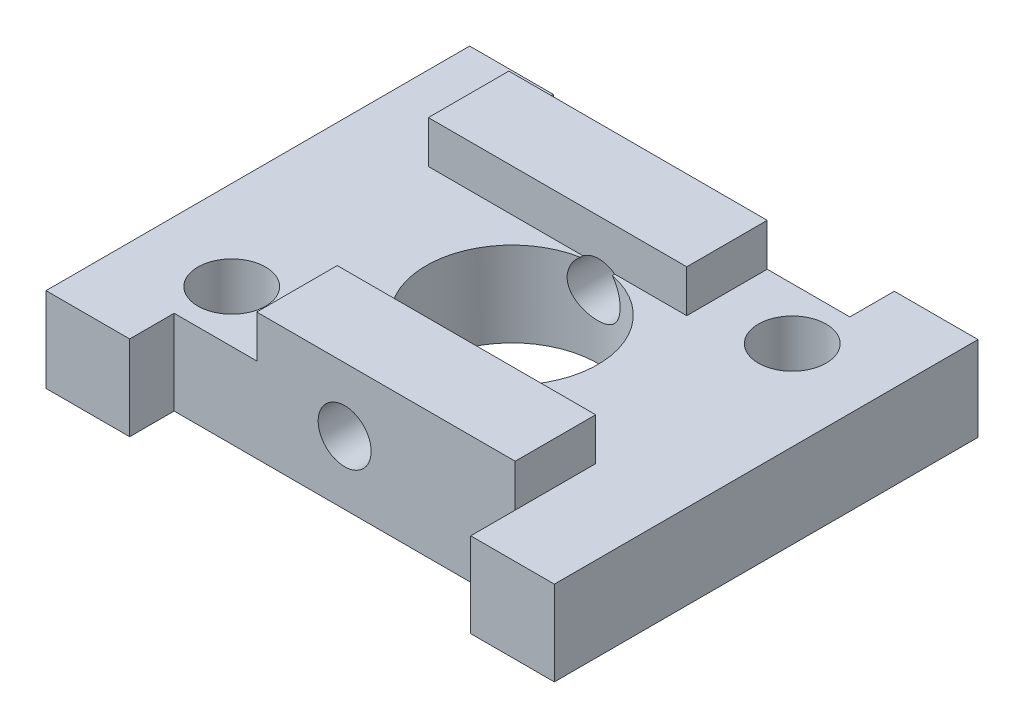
ISO-10303-21;
HEADER;
FILE_DESCRIPTION(('STEP AP214'),'2;1');
FILE_NAME('part.step','',(''),(''),'','','');
FILE_SCHEMA(('AUTOMOTIVE_DESIGN { 1 0 10303 214 1 1 1 1 }'));
ENDSEC;
DATA;
#1=APPLICATION_CONTEXT('core data for automotive mechanical design processes');
#2=APPLICATION_PROTOCOL_DEFINITION('international standard','automotive_design',2000,#1);
#3=PRODUCT_CONTEXT('',#1,'mechanical');
#4=PRODUCT('Part','Part','',(#3));
#5=PRODUCT_RELATED_PRODUCT_CATEGORY('part','',(#4));
#6=PRODUCT_DEFINITION_FORMATION('','',#4);
#7=PRODUCT_DEFINITION_CONTEXT('part definition',#1,'design');
#8=PRODUCT_DEFINITION('design','',#6,#7);
#9=PRODUCT_DEFINITION_SHAPE('','',#8);
#10=(LENGTH_UNIT() NAMED_UNIT(*) SI_UNIT(.MILLI.,.METRE.));
#11=(NAMED_UNIT(*) PLANE_ANGLE_UNIT() SI_UNIT($,.RADIAN.));
#12=(NAMED_UNIT(*) SI_UNIT($,.STERADIAN.) SOLID_ANGLE_UNIT());
#13=UNCERTAINTY_MEASURE_WITH_UNIT(LENGTH_MEASURE(1.E-05),#10,'distance_accuracy_value','');
#14=(GEOMETRIC_REPRESENTATION_CONTEXT(3) GLOBAL_UNCERTAINTY_ASSIGNED_CONTEXT((#13)) GLOBAL_UNIT_ASSIGNED_CONTEXT((#10,
#11,#12)) REPRESENTATION_CONTEXT('',''));
#15=CARTESIAN_POINT('',(0.,0.,0.));
#16=DIRECTION('',(0.,0.,1.));
#17=DIRECTION('',(1.,0.,0.));
#18=AXIS2_PLACEMENT_3D('',#15,#16,#17);
#19=CARTESIAN_POINT('',(0.,2.,0.));
#20=DIRECTION('',(0.,1.,0.));
#21=DIRECTION('',(0.,0.,1.));
#22=AXIS2_PLACEMENT_3D('',#19,#20,#21);
#23=PLANE('',#22);
#24=DIRECTION('',(0.,0.,-1.));
#25=VECTOR('',#24,1.);
#26=CARTESIAN_POINT('',(0.37499999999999,2.,-3.95));
#27=LINE('',#26,#25);
#28=CARTESIAN_POINT('',(0.375000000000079,2.00000000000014,-1.98997487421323));
#29=VERTEX_POINT('',#28);
#30=CARTESIAN_POINT('',(0.37499999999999,2.,-2.05));
#31=VERTEX_POINT('',#30);
#32=EDGE_CURVE('E204',#29,#31,#27,.T.);
#33=ORIENTED_EDGE('',*,*,#32,.F.);
#34=CARTESIAN_POINT('',(0.,2.,0.));
#35=DIRECTION('',(0.,1.,0.));
#36=DIRECTION('',(0.,0.,1.));
#37=AXIS2_PLACEMENT_3D('',#34,#35,#36);
#38=CIRCLE('',#37,2.025);
#39=CARTESIAN_POINT('',(0.37499999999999,2.,1.98997487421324));
#40=VERTEX_POINT('',#39);
#41=EDGE_CURVE('E213',#40,#29,#38,.T.);
#42=ORIENTED_EDGE('',*,*,#41,.F.);
#43=DIRECTION('',(0.,0.,1.));
#44=VECTOR('',#43,1.);
#45=CARTESIAN_POINT('',(0.37499999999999,2.,3.95));
#46=LINE('',#45,#44);
#47=CARTESIAN_POINT('',(0.37499999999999,2.,2.05));
#48=VERTEX_POINT('',#47);
#49=EDGE_CURVE('E71',#48,#40,#46,.F.);
#50=ORIENTED_EDGE('',*,*,#49,.F.);
#51=DIRECTION('',(-1.,0.,0.));
#52=VECTOR('',#51,1.);
#53=CARTESIAN_POINT('',(4.025,2.,2.05));
#54=LINE('',#53,#52);
#55=CARTESIAN_POINT('',(4.025,2.,2.05));
#56=VERTEX_POINT('',#55);
#57=EDGE_CURVE('E749',#56,#48,#54,.T.);
#58=ORIENTED_EDGE('',*,*,#57,.F.);
#59=DIRECTION('',(0.,0.,-1.));
#60=VECTOR('',#59,1.);
#61=CARTESIAN_POINT('',(4.025,2.,3.95));
#62=LINE('',#61,#60);
#63=CARTESIAN_POINT('',(4.025,2.,3.95));
#64=VERTEX_POINT('',#63);
#65=EDGE_CURVE('E754',#64,#56,#62,.T.);
#66=ORIENTED_EDGE('',*,*,#65,.F.);
#67=DIRECTION('',(0.,0.,-1.));
#68=VECTOR('',#67,1.);
#69=CARTESIAN_POINT('',(4.025,2.,5.));
#70=LINE('',#69,#68);
#71=CARTESIAN_POINT('',(4.025,2.,5.));
#72=VERTEX_POINT('',#71);
#73=EDGE_CURVE('E359',#72,#64,#70,.T.);
#74=ORIENTED_EDGE('',*,*,#73,.F.);
#75=DIRECTION('',(1.,0.,0.));
#76=VECTOR('',#75,1.);
#77=CARTESIAN_POINT('',(-6.,2.,5.));
#78=LINE('',#77,#76);
#79=CARTESIAN_POINT('',(6.,2.,5.));
#80=VERTEX_POINT('',#79);
#81=EDGE_CURVE('E253',#72,#80,#78,.T.);
#82=ORIENTED_EDGE('',*,*,#81,.T.);
#83=DIRECTION('',(0.,0.,-1.));
#84=VECTOR('',#83,1.);
#85=CARTESIAN_POINT('',(6.,2.,-5.));
#86=LINE('',#85,#84);
#87=CARTESIAN_POINT('',(6.,2.,-5.));
#88=VERTEX_POINT('',#87);
#89=EDGE_CURVE('E240',#80,#88,#86,.T.);
#90=ORIENTED_EDGE('',*,*,#89,.T.);
#91=DIRECTION('',(-1.,0.,0.));
#92=VECTOR('',#91,1.);
#93=CARTESIAN_POINT('',(-6.,2.,-5.));
#94=LINE('',#93,#92);
#95=CARTESIAN_POINT('',(4.025,2.,-5.));
#96=VERTEX_POINT('',#95);
#97=EDGE_CURVE('E246',#88,#96,#94,.T.);
#98=ORIENTED_EDGE('',*,*,#97,.T.);
#99=DIRECTION('',(0.,0.,-1.));
#100=VECTOR('',#99,1.);
#101=CARTESIAN_POINT('',(4.025,2.,-5.));
#102=LINE('',#101,#100);
#103=CARTESIAN_POINT('',(4.025,2.,-3.95));
#104=VERTEX_POINT('',#103);
#105=EDGE_CURVE('E652',#104,#96,#102,.T.);
#106=ORIENTED_EDGE('',*,*,#105,.F.);
#107=DIRECTION('',(1.,0.,0.));
#108=VECTOR('',#107,1.);
#109=CARTESIAN_POINT('',(-4.025,2.,-3.95));
#110=LINE('',#109,#108);
#111=CARTESIAN_POINT('',(2.075,2.,-3.95));
#112=VERTEX_POINT('',#111);
#113=EDGE_CURVE('E653',#112,#104,#110,.T.);
#114=ORIENTED_EDGE('',*,*,#113,.F.);
#115=DIRECTION('',(0.,0.,-1.));
#116=VECTOR('',#115,1.);
#117=CARTESIAN_POINT('',(2.075,2.,-3.95));
#118=LINE('',#117,#116);
#119=CARTESIAN_POINT('',(2.075,2.,-2.05));
#120=VERTEX_POINT('',#119);
#121=EDGE_CURVE('E708',#120,#112,#118,.T.);
#122=ORIENTED_EDGE('',*,*,#121,.F.);
#123=DIRECTION('',(1.,0.,0.));
#124=VECTOR('',#123,1.);
#125=CARTESIAN_POINT('',(-4.025,2.,-2.05));
#126=LINE('',#125,#124);
#127=EDGE_CURVE('E215',#31,#120,#126,.T.);
#128=ORIENTED_EDGE('',*,*,#127,.F.);
#129=EDGE_LOOP('',(#33,#42,#50,#58,#66,#74,#82,#90,#98,#106,#114,#122,#128));
#130=FACE_BOUND('',#129,.T.);
#131=CARTESIAN_POINT('',(3.89097221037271,2.,-2.72448807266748));
#132=DIRECTION('',(0.,1.,0.));
#133=DIRECTION('',(0.,0.,1.));
#134=AXIS2_PLACEMENT_3D('',#131,#132,#133);
#135=CIRCLE('',#134,0.799999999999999);
#136=CARTESIAN_POINT('',(3.89097221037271,2.,-1.92448807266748));
#137=VERTEX_POINT('',#136);
#138=EDGE_CURVE('E234',#137,#137,#135,.T.);
#139=ORIENTED_EDGE('',*,*,#138,.F.);
#140=EDGE_LOOP('',(#139));
#141=FACE_BOUND('',#140,.T.);
#142=ADVANCED_FACE('F43',(#130,#141),#23,.T.);
#143=DIRECTION('',(0.,0.,-1.));
#144=VECTOR('',#143,1.);
#145=CARTESIAN_POINT('',(-0.374999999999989,2.,-3.95));
#146=LINE('',#145,#144);
#147=CARTESIAN_POINT('',(-0.374999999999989,2.,-2.05));
#148=VERTEX_POINT('',#147);
#149=CARTESIAN_POINT('',(-0.374999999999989,2.,-1.98997487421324));
#150=VERTEX_POINT('',#149);
#151=EDGE_CURVE('E63',#148,#150,#146,.F.);
#152=ORIENTED_EDGE('',*,*,#151,.F.);
#153=CARTESIAN_POINT('',(-4.025,2.,-2.05));
#154=VERTEX_POINT('',#153);
#155=EDGE_CURVE('E718',#154,#148,#126,.T.);
#156=ORIENTED_EDGE('',*,*,#155,.F.);
#157=DIRECTION('',(0.,0.,1.));
#158=VECTOR('',#157,1.);
#159=CARTESIAN_POINT('',(-4.025,2.,-3.95));
#160=LINE('',#159,#158);
#161=CARTESIAN_POINT('',(-4.025,2.,-3.95));
#162=VERTEX_POINT('',#161);
#163=EDGE_CURVE('E693',#162,#154,#160,.T.);
#164=ORIENTED_EDGE('',*,*,#163,.F.);
#165=DIRECTION('',(0.,0.,1.));
#166=VECTOR('',#165,1.);
#167=CARTESIAN_POINT('',(-4.025,2.,-5.));
#168=LINE('',#167,#166);
#169=CARTESIAN_POINT('',(-4.025,2.,-5.));
#170=VERTEX_POINT('',#169);
#171=EDGE_CURVE('E370',#170,#162,#168,.T.);
#172=ORIENTED_EDGE('',*,*,#171,.F.);
#173=CARTESIAN_POINT('',(-6.,2.,-5.));
#174=VERTEX_POINT('',#173);
#175=EDGE_CURVE('E244',#170,#174,#94,.T.);
#176=ORIENTED_EDGE('',*,*,#175,.T.);
#177=DIRECTION('',(0.,0.,1.));
#178=VECTOR('',#177,1.);
#179=CARTESIAN_POINT('',(-6.,2.,-5.));
#180=LINE('',#179,#178);
#181=CARTESIAN_POINT('',(-6.,2.,5.));
#182=VERTEX_POINT('',#181);
#183=EDGE_CURVE('E250',#174,#182,#180,.T.);
#184=ORIENTED_EDGE('',*,*,#183,.T.);
#185=CARTESIAN_POINT('',(-4.025,2.,5.));
#186=VERTEX_POINT('',#185);
#187=EDGE_CURVE('E254',#182,#186,#78,.T.);
#188=ORIENTED_EDGE('',*,*,#187,.T.);
#189=DIRECTION('',(0.,0.,1.));
#190=VECTOR('',#189,1.);
#191=CARTESIAN_POINT('',(-4.025,2.,5.));
#192=LINE('',#191,#190);
#193=CARTESIAN_POINT('',(-4.025,2.,3.95));
#194=VERTEX_POINT('',#193);
#195=EDGE_CURVE('E356',#194,#186,#192,.T.);
#196=ORIENTED_EDGE('',*,*,#195,.F.);
#197=DIRECTION('',(-1.,0.,0.));
#198=VECTOR('',#197,1.);
#199=CARTESIAN_POINT('',(-4.025,2.,3.95));
#200=LINE('',#199,#198);
#201=CARTESIAN_POINT('',(-2.075,2.,3.95));
#202=VERTEX_POINT('',#201);
#203=EDGE_CURVE('E347',#202,#194,#200,.T.);
#204=ORIENTED_EDGE('',*,*,#203,.F.);
#205=DIRECTION('',(0.,0.,1.));
#206=VECTOR('',#205,1.);
#207=CARTESIAN_POINT('',(-2.075,2.,3.95));
#208=LINE('',#207,#206);
#209=CARTESIAN_POINT('',(-2.075,2.,2.05));
#210=VERTEX_POINT('',#209);
#211=EDGE_CURVE('E744',#210,#202,#208,.T.);
#212=ORIENTED_EDGE('',*,*,#211,.F.);
#213=CARTESIAN_POINT('',(-0.37499999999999,2.,2.05));
#214=VERTEX_POINT('',#213);
#215=EDGE_CURVE('E753',#214,#210,#54,.T.);
#216=ORIENTED_EDGE('',*,*,#215,.F.);
#217=DIRECTION('',(0.,0.,1.));
#218=VECTOR('',#217,1.);
#219=CARTESIAN_POINT('',(-0.37499999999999,2.,3.95));
#220=LINE('',#219,#218);
#221=CARTESIAN_POINT('',(-0.375000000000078,2.00000000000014,1.98997487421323));
#222=VERTEX_POINT('',#221);
#223=EDGE_CURVE('E758',#222,#214,#220,.T.);
#224=ORIENTED_EDGE('',*,*,#223,.F.);
#225=EDGE_CURVE('E224',#150,#222,#38,.T.);
#226=ORIENTED_EDGE('',*,*,#225,.F.);
#227=EDGE_LOOP('',(#152,#156,#164,#172,#176,#184,#188,#196,#204,#212,#216,#224,#226));
#228=FACE_BOUND('',#227,.T.);
#229=CARTESIAN_POINT('',(-3.89097221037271,2.,2.72448807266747));
#230=DIRECTION('',(0.,1.,0.));
#231=DIRECTION('',(0.,0.,1.));
#232=AXIS2_PLACEMENT_3D('',#229,#230,#231);
#233=CIRCLE('',#232,0.8);
#234=CARTESIAN_POINT('',(-3.89097221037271,2.,3.52448807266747));
#235=VERTEX_POINT('',#234);
#236=EDGE_CURVE('E327',#235,#235,#233,.T.);
#237=ORIENTED_EDGE('',*,*,#236,.F.);
#238=EDGE_LOOP('',(#237));
#239=FACE_BOUND('',#238,.T.);
#240=ADVANCED_FACE('F315',(#228,#239),#23,.T.);
#241=CARTESIAN_POINT('',(-6.,2.,-5.));
#242=DIRECTION('',(0.,0.,1.));
#243=DIRECTION('',(1.,0.,0.));
#244=AXIS2_PLACEMENT_3D('',#241,#242,#243);
#245=PLANE('',#244);
#246=ORIENTED_EDGE('',*,*,#175,.F.);
#247=DIRECTION('',(0.,1.,0.));
#248=VECTOR('',#247,1.);
#249=CARTESIAN_POINT('',(-4.025,0.,-5.));
#250=LINE('',#249,#248);
#251=CARTESIAN_POINT('',(-4.025,0.,-5.));
#252=VERTEX_POINT('',#251);
#253=EDGE_CURVE('E239',#252,#170,#250,.T.);
#254=ORIENTED_EDGE('',*,*,#253,.F.);
#255=DIRECTION('',(-1.,0.,0.));
#256=VECTOR('',#255,1.);
#257=CARTESIAN_POINT('',(-6.,0.,-5.));
#258=LINE('',#257,#256);
#259=CARTESIAN_POINT('',(-6.,0.,-5.));
#260=VERTEX_POINT('',#259);
#261=EDGE_CURVE('E229',#252,#260,#258,.T.);
#262=ORIENTED_EDGE('',*,*,#261,.T.);
#263=DIRECTION('',(0.,-1.,0.));
#264=VECTOR('',#263,1.);
#265=CARTESIAN_POINT('',(-6.,2.,-5.));
#266=LINE('',#265,#264);
#267=EDGE_CURVE('E277',#174,#260,#266,.T.);
#268=ORIENTED_EDGE('',*,*,#267,.F.);
#269=EDGE_LOOP('',(#246,#254,#262,#268));
#270=FACE_BOUND('',#269,.T.);
#271=ADVANCED_FACE('F304',(#270),#245,.F.);
#272=CARTESIAN_POINT('',(-6.,2.,5.));
#273=DIRECTION('',(0.,0.,-1.));
#274=DIRECTION('',(-1.,0.,0.));
#275=AXIS2_PLACEMENT_3D('',#272,#273,#274);
#276=PLANE('',#275);
#277=DIRECTION('',(1.,0.,0.));
#278=VECTOR('',#277,1.);
#279=CARTESIAN_POINT('',(-6.,0.,5.));
#280=LINE('',#279,#278);
#281=CARTESIAN_POINT('',(-6.,0.,5.));
#282=VERTEX_POINT('',#281);
#283=CARTESIAN_POINT('',(-4.025,0.,5.));
#284=VERTEX_POINT('',#283);
#285=EDGE_CURVE('E245',#282,#284,#280,.T.);
#286=ORIENTED_EDGE('',*,*,#285,.T.);
#287=DIRECTION('',(0.,1.,0.));
#288=VECTOR('',#287,1.);
#289=CARTESIAN_POINT('',(-4.025,0.,5.));
#290=LINE('',#289,#288);
#291=EDGE_CURVE('E355',#284,#186,#290,.T.);
#292=ORIENTED_EDGE('',*,*,#291,.T.);
#293=ORIENTED_EDGE('',*,*,#187,.F.);
#294=DIRECTION('',(0.,-1.,0.));
#295=VECTOR('',#294,1.);
#296=CARTESIAN_POINT('',(-6.,2.,5.));
#297=LINE('',#296,#295);
#298=EDGE_CURVE('E273',#182,#282,#297,.T.);
#299=ORIENTED_EDGE('',*,*,#298,.T.);
#300=EDGE_LOOP('',(#286,#292,#293,#299));
#301=FACE_BOUND('',#300,.T.);
#302=ADVANCED_FACE('F312',(#301),#276,.F.);
#303=CARTESIAN_POINT('',(0.,0.,0.));
#304=DIRECTION('',(0.,1.,0.));
#305=DIRECTION('',(0.,0.,1.));
#306=AXIS2_PLACEMENT_3D('',#303,#304,#305);
#307=PLANE('',#306);
#308=ORIENTED_EDGE('',*,*,#261,.F.);
#309=DIRECTION('',(0.,0.,1.));
#310=VECTOR('',#309,1.);
#311=CARTESIAN_POINT('',(-4.025,0.,-5.));
#312=LINE('',#311,#310);
#313=CARTESIAN_POINT('',(-4.025,0.,-3.95));
#314=VERTEX_POINT('',#313);
#315=EDGE_CURVE('E657',#252,#314,#312,.T.);
#316=ORIENTED_EDGE('',*,*,#315,.T.);
#317=DIRECTION('',(1.,0.,0.));
#318=VECTOR('',#317,1.);
#319=CARTESIAN_POINT('',(-4.025,0.,-3.95));
#320=LINE('',#319,#318);
#321=CARTESIAN_POINT('',(4.025,0.,-3.95));
#322=VERTEX_POINT('',#321);
#323=EDGE_CURVE('E661',#314,#322,#320,.T.);
#324=ORIENTED_EDGE('',*,*,#323,.T.);
#325=DIRECTION('',(0.,0.,-1.));
#326=VECTOR('',#325,1.);
#327=CARTESIAN_POINT('',(4.025,0.,-5.));
#328=LINE('',#327,#326);
#329=CARTESIAN_POINT('',(4.025,0.,-5.));
#330=VERTEX_POINT('',#329);
#331=EDGE_CURVE('E675',#322,#330,#328,.T.);
#332=ORIENTED_EDGE('',*,*,#331,.T.);
#333=CARTESIAN_POINT('',(6.,0.,-5.));
#334=VERTEX_POINT('',#333);
#335=EDGE_CURVE('E259',#334,#330,#258,.T.);
#336=ORIENTED_EDGE('',*,*,#335,.F.);
#337=DIRECTION('',(0.,0.,-1.));
#338=VECTOR('',#337,1.);
#339=CARTESIAN_POINT('',(6.,0.,-5.));
#340=LINE('',#339,#338);
#341=CARTESIAN_POINT('',(6.,0.,5.));
#342=VERTEX_POINT('',#341);
#343=EDGE_CURVE('E223',#342,#334,#340,.T.);
#344=ORIENTED_EDGE('',*,*,#343,.F.);
#345=CARTESIAN_POINT('',(4.025,0.,5.));
#346=VERTEX_POINT('',#345);
#347=EDGE_CURVE('E266',#346,#342,#280,.T.);
#348=ORIENTED_EDGE('',*,*,#347,.F.);
#349=DIRECTION('',(0.,0.,-1.));
#350=VECTOR('',#349,1.);
#351=CARTESIAN_POINT('',(4.025,0.,5.));
#352=LINE('',#351,#350);
#353=CARTESIAN_POINT('',(4.025,0.,3.95));
#354=VERTEX_POINT('',#353);
#355=EDGE_CURVE('E346',#346,#354,#352,.T.);
#356=ORIENTED_EDGE('',*,*,#355,.T.);
#357=DIRECTION('',(-1.,0.,0.));
#358=VECTOR('',#357,1.);
#359=CARTESIAN_POINT('',(-4.025,0.,3.95));
#360=LINE('',#359,#358);
#361=CARTESIAN_POINT('',(-4.025,0.,3.95));
#362=VERTEX_POINT('',#361);
#363=EDGE_CURVE('E351',#354,#362,#360,.T.);
#364=ORIENTED_EDGE('',*,*,#363,.T.);
#365=DIRECTION('',(0.,0.,1.));
#366=VECTOR('',#365,1.);
#367=CARTESIAN_POINT('',(-4.025,0.,5.));
#368=LINE('',#367,#366);
#369=EDGE_CURVE('E342',#362,#284,#368,.T.);
#370=ORIENTED_EDGE('',*,*,#369,.T.);
#371=ORIENTED_EDGE('',*,*,#285,.F.);
#372=DIRECTION('',(0.,0.,1.));
#373=VECTOR('',#372,1.);
#374=CARTESIAN_POINT('',(-6.,0.,-5.));
#375=LINE('',#374,#373);
#376=EDGE_CURVE('E263',#260,#282,#375,.T.);
#377=ORIENTED_EDGE('',*,*,#376,.F.);
#378=EDGE_LOOP('',(#308,#316,#324,#332,#336,#344,#348,#356,#364,#370,#371,#377));
#379=FACE_BOUND('',#378,.T.);
#380=CARTESIAN_POINT('',(-3.89097221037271,0.,2.72448807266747));
#381=DIRECTION('',(0.,1.,0.));
#382=DIRECTION('',(0.,0.,1.));
#383=AXIS2_PLACEMENT_3D('',#380,#381,#382);
#384=CIRCLE('',#383,0.8);
#385=CARTESIAN_POINT('',(-3.89097221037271,0.,3.52448807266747));
#386=VERTEX_POINT('',#385);
#387=EDGE_CURVE('E330',#386,#386,#384,.T.);
#388=ORIENTED_EDGE('',*,*,#387,.T.);
#389=EDGE_LOOP('',(#388));
#390=FACE_BOUND('',#389,.T.);
#391=CARTESIAN_POINT('',(3.89097221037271,0.,-2.72448807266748));
#392=DIRECTION('',(0.,1.,0.));
#393=DIRECTION('',(0.,0.,1.));
#394=AXIS2_PLACEMENT_3D('',#391,#392,#393);
#395=CIRCLE('',#394,0.799999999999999);
#396=CARTESIAN_POINT('',(3.89097221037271,0.,-1.92448807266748));
#397=VERTEX_POINT('',#396);
#398=EDGE_CURVE('E360',#397,#397,#395,.T.);
#399=ORIENTED_EDGE('',*,*,#398,.T.);
#400=EDGE_LOOP('',(#399));
#401=FACE_BOUND('',#400,.T.);
#402=CARTESIAN_POINT('',(0.,0.,0.));
#403=DIRECTION('',(0.,1.,0.));
#404=DIRECTION('',(0.,0.,1.));
#405=AXIS2_PLACEMENT_3D('',#402,#403,#404);
#406=CIRCLE('',#405,2.025);
#407=CARTESIAN_POINT('',(0.,0.,2.025));
#408=VERTEX_POINT('',#407);
#409=EDGE_CURVE('E231',#408,#408,#406,.T.);
#410=ORIENTED_EDGE('',*,*,#409,.T.);
#411=EDGE_LOOP('',(#410));
#412=FACE_BOUND('',#411,.T.);
#413=ADVANCED_FACE('F298',(#379,#390,#401,#412),#307,.F.);
#414=CARTESIAN_POINT('',(6.,2.,-5.));
#415=DIRECTION('',(-1.,0.,0.));
#416=DIRECTION('',(0.,0.,1.));
#417=AXIS2_PLACEMENT_3D('',#414,#415,#416);
#418=PLANE('',#417);
#419=ORIENTED_EDGE('',*,*,#343,.T.);
#420=DIRECTION('',(0.,-1.,0.));
#421=VECTOR('',#420,1.);
#422=CARTESIAN_POINT('',(6.,2.,-5.));
#423=LINE('',#422,#421);
#424=EDGE_CURVE('E281',#88,#334,#423,.T.);
#425=ORIENTED_EDGE('',*,*,#424,.F.);
#426=ORIENTED_EDGE('',*,*,#89,.F.);
#427=DIRECTION('',(0.,-1.,0.));
#428=VECTOR('',#427,1.);
#429=CARTESIAN_POINT('',(6.,2.,5.));
#430=LINE('',#429,#428);
#431=EDGE_CURVE('E257',#80,#342,#430,.T.);
#432=ORIENTED_EDGE('',*,*,#431,.T.);
#433=EDGE_LOOP('',(#419,#425,#426,#432));
#434=FACE_BOUND('',#433,.T.);
#435=ADVANCED_FACE('F294',(#434),#418,.F.);
#436=ORIENTED_EDGE('',*,*,#335,.T.);
#437=DIRECTION('',(0.,1.,0.));
#438=VECTOR('',#437,1.);
#439=CARTESIAN_POINT('',(4.025,0.,-5.));
#440=LINE('',#439,#438);
#441=EDGE_CURVE('E650',#330,#96,#440,.T.);
#442=ORIENTED_EDGE('',*,*,#441,.T.);
#443=ORIENTED_EDGE('',*,*,#97,.F.);
#444=ORIENTED_EDGE('',*,*,#424,.T.);
#445=EDGE_LOOP('',(#436,#442,#443,#444));
#446=FACE_BOUND('',#445,.T.);
#447=ADVANCED_FACE('F297',(#446),#245,.F.);
#448=CARTESIAN_POINT('',(-6.,2.,-5.));
#449=DIRECTION('',(1.,0.,0.));
#450=DIRECTION('',(0.,0.,-1.));
#451=AXIS2_PLACEMENT_3D('',#448,#449,#450);
#452=PLANE('',#451);
#453=ORIENTED_EDGE('',*,*,#376,.T.);
#454=ORIENTED_EDGE('',*,*,#298,.F.);
#455=ORIENTED_EDGE('',*,*,#183,.F.);
#456=ORIENTED_EDGE('',*,*,#267,.T.);
#457=EDGE_LOOP('',(#453,#454,#455,#456));
#458=FACE_BOUND('',#457,.T.);
#459=ADVANCED_FACE('F302',(#458),#452,.F.);
#460=ORIENTED_EDGE('',*,*,#81,.F.);
#461=DIRECTION('',(0.,1.,0.));
#462=VECTOR('',#461,1.);
#463=CARTESIAN_POINT('',(4.025,0.,5.));
#464=LINE('',#463,#462);
#465=EDGE_CURVE('E375',#346,#72,#464,.T.);
#466=ORIENTED_EDGE('',*,*,#465,.F.);
#467=ORIENTED_EDGE('',*,*,#347,.T.);
#468=ORIENTED_EDGE('',*,*,#431,.F.);
#469=EDGE_LOOP('',(#460,#466,#467,#468));
#470=FACE_BOUND('',#469,.T.);
#471=ADVANCED_FACE('F307',(#470),#276,.F.);
#472=CARTESIAN_POINT('',(0.,2.,0.));
#473=DIRECTION('',(0.,-1.,0.));
#474=DIRECTION('',(0.,0.,-1.));
#475=AXIS2_PLACEMENT_3D('',#472,#473,#474);
#476=CYLINDRICAL_SURFACE('',#475,2.025);
#477=CARTESIAN_POINT('',(-0.374999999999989,2.,-1.98997487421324));
#478=CARTESIAN_POINT('',(-0.403287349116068,1.97880791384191,-1.98464915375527));
#479=CARTESIAN_POINT('',(-0.429714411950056,1.95521766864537,-1.97903877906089));
#480=CARTESIAN_POINT('',(-0.47825948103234,1.90390013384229,-1.9678693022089));
#481=CARTESIAN_POINT('',(-0.500373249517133,1.87616882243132,-1.9623102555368));
#482=CARTESIAN_POINT('',(-0.539661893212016,1.81724801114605,-1.95187253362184));
#483=CARTESIAN_POINT('',(-0.556832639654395,1.78605565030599,-1.9469944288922));
#484=CARTESIAN_POINT('',(-0.58566953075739,1.7210821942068,-1.93851567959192));
#485=CARTESIAN_POINT('',(-0.5973401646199,1.68730323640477,-1.93491399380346));
#486=CARTESIAN_POINT('',(-0.614568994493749,1.61892689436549,-1.92951043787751));
#487=CARTESIAN_POINT('',(-0.620264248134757,1.58436733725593,-1.92766830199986));
#488=CARTESIAN_POINT('',(-0.62580145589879,1.51472989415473,-1.92587815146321));
#489=CARTESIAN_POINT('',(-0.625643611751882,1.4796520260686,-1.92593007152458));
#490=CARTESIAN_POINT('',(-0.61960301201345,1.41143221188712,-1.92788115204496));
#491=CARTESIAN_POINT('',(-0.613943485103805,1.37826807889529,-1.92970828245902));
#492=CARTESIAN_POINT('',(-0.597429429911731,1.31338850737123,-1.93488427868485));
#493=CARTESIAN_POINT('',(-0.586574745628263,1.28167311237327,-1.93823319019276));
#494=CARTESIAN_POINT('',(-0.559838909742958,1.2200940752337,-1.9461246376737));
#495=CARTESIAN_POINT('',(-0.543892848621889,1.19026065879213,-1.95068245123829));
#496=CARTESIAN_POINT('',(-0.507470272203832,1.13362131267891,-1.96047282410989));
#497=CARTESIAN_POINT('',(-0.486992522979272,1.10681621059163,-1.96570556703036));
#498=CARTESIAN_POINT('',(-0.441012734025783,1.05574218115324,-1.97654089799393));
#499=CARTESIAN_POINT('',(-0.41532791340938,1.03163881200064,-1.9821495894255));
#500=CARTESIAN_POINT('',(-0.360216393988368,0.988039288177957,-1.99290148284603));
#501=CARTESIAN_POINT('',(-0.330789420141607,0.968543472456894,-1.99804465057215));
#502=CARTESIAN_POINT('',(-0.268680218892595,0.934580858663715,-2.00734374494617));
#503=CARTESIAN_POINT('',(-0.235972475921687,0.920158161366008,-2.01149091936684));
#504=CARTESIAN_POINT('',(-0.168437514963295,0.897068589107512,-2.01826745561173));
#505=CARTESIAN_POINT('',(-0.133610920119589,0.888400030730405,-2.02089726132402));
#506=CARTESIAN_POINT('',(-0.0642239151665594,0.877353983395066,-2.02426813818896));
#507=CARTESIAN_POINT('',(-0.0297022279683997,0.874753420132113,-2.02507614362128));
#508=CARTESIAN_POINT('',(0.0392897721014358,0.875283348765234,-2.02491250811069));
#509=CARTESIAN_POINT('',(0.0737600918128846,0.878412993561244,-2.02394113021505));
#510=CARTESIAN_POINT('',(0.14077643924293,0.890134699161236,-2.02037274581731));
#511=CARTESIAN_POINT('',(0.173349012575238,0.898588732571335,-2.01781684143));
#512=CARTESIAN_POINT('',(0.236603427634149,0.92054760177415,-2.01138146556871));
#513=CARTESIAN_POINT('',(0.267285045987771,0.934053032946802,-2.00750183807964));
#514=CARTESIAN_POINT('',(0.326680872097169,0.966081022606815,-1.99870646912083));
#515=CARTESIAN_POINT('',(0.355332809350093,0.984712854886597,-1.99376874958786));
#516=CARTESIAN_POINT('',(0.409178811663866,1.0263372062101,-1.98341894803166));
#517=CARTESIAN_POINT('',(0.434371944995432,1.04933089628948,-1.9780067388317));
#518=CARTESIAN_POINT('',(0.481603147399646,1.10008615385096,-1.9670522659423));
#519=CARTESIAN_POINT('',(0.503480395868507,1.1279983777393,-1.96151313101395));
#520=CARTESIAN_POINT('',(0.542256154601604,1.18721328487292,-1.95115029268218));
#521=CARTESIAN_POINT('',(0.559154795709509,1.2185158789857,-1.94632657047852));
#522=CARTESIAN_POINT('',(0.58740334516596,1.28358408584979,-1.93798861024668));
#523=CARTESIAN_POINT('',(0.598770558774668,1.31734163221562,-1.93447029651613));
#524=CARTESIAN_POINT('',(0.615620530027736,1.38642487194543,-1.92917491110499));
#525=CARTESIAN_POINT('',(0.621105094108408,1.42175008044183,-1.92739730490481));
#526=CARTESIAN_POINT('',(0.625867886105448,1.4912970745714,-1.92585566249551));
#527=CARTESIAN_POINT('',(0.625407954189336,1.52549923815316,-1.9260066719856));
#528=CARTESIAN_POINT('',(0.618933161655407,1.59330811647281,-1.92809701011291));
#529=CARTESIAN_POINT('',(0.612919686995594,1.62691497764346,-1.93003589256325));
#530=CARTESIAN_POINT('',(0.595691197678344,1.6920834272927,-1.93542136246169));
#531=CARTESIAN_POINT('',(0.584556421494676,1.72366829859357,-1.93884464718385));
#532=CARTESIAN_POINT('',(0.557460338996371,1.78456168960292,-1.94680815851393));
#533=CARTESIAN_POINT('',(0.541495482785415,1.81386851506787,-1.95134920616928));
#534=CARTESIAN_POINT('',(0.503437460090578,1.87215244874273,-1.96152925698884));
#535=CARTESIAN_POINT('',(0.480905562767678,1.90083254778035,-1.96723163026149));
#536=CARTESIAN_POINT('',(0.43123804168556,1.95385689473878,-1.97871490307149));
#537=CARTESIAN_POINT('',(0.404102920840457,1.97820161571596,-1.98449579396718));
#538=CARTESIAN_POINT('',(0.37499999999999,2.,-1.98997487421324));
#539=B_SPLINE_CURVE_WITH_KNOTS('',3,(#477,#478,#479,#480,#481,#482,#483,#484,#485,#486,#487,
#488,#489,#490,#491,#492,#493,#494,#495,#496,#497,#498,#499,#500,#501,#502,#503,#504,#505,#506,
#507,#508,#509,#510,#511,#512,#513,#514,#515,#516,#517,#518,#519,#520,#521,#522,#523,#524,#525,
#526,#527,#528,#529,#530,#531,#532,#533,#534,#535,#536,#537,#538),.UNSPECIFIED.,.F.,.F.,(4,2,2,
2,2,2,2,2,2,2,2,2,2,2,2,2,2,2,2,2,2,2,2,2,2,2,2,2,2,2,4),(0.,0.107098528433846,
0.214301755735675,0.321594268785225,0.428799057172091,0.533487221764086,0.638171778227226,
0.73877879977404,0.839388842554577,0.94133652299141,1.04331199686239,1.14981745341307,
1.2563307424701,1.36374831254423,1.47113444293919,1.57450597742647,1.67786223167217,
1.77864357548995,1.87943680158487,1.98257177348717,2.08573447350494,2.19290951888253,
2.30008174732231,2.40691649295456,2.5137184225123,2.61583264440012,2.71792138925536,
2.81846244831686,2.91907758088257,3.02927146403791,3.13945331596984),.UNSPECIFIED.);
#540=EDGE_CURVE('E11',#150,#29,#539,.T.);
#541=ORIENTED_EDGE('',*,*,#540,.F.);
#542=ORIENTED_EDGE('',*,*,#225,.T.);
#543=CARTESIAN_POINT('',(0.37499999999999,2.,1.98997487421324));
#544=CARTESIAN_POINT('',(0.403287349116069,1.97880791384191,1.98464915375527));
#545=CARTESIAN_POINT('',(0.429714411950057,1.95521766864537,1.97903877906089));
#546=CARTESIAN_POINT('',(0.478259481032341,1.90390013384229,1.9678693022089));
#547=CARTESIAN_POINT('',(0.500373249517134,1.87616882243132,1.9623102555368));
#548=CARTESIAN_POINT('',(0.539661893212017,1.81724801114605,1.95187253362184));
#549=CARTESIAN_POINT('',(0.556832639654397,1.78605565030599,1.9469944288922));
#550=CARTESIAN_POINT('',(0.585669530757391,1.7210821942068,1.93851567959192));
#551=CARTESIAN_POINT('',(0.597340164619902,1.68730323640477,1.93491399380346));
#552=CARTESIAN_POINT('',(0.61456899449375,1.61892689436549,1.92951043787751));
#553=CARTESIAN_POINT('',(0.620264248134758,1.58436733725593,1.92766830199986));
#554=CARTESIAN_POINT('',(0.625801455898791,1.51472989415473,1.92587815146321));
#555=CARTESIAN_POINT('',(0.625643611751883,1.4796520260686,1.92593007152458));
#556=CARTESIAN_POINT('',(0.619603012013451,1.41143221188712,1.92788115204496));
#557=CARTESIAN_POINT('',(0.613943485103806,1.37826807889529,1.92970828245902));
#558=CARTESIAN_POINT('',(0.597429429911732,1.31338850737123,1.93488427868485));
#559=CARTESIAN_POINT('',(0.586574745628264,1.28167311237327,1.93823319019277));
#560=CARTESIAN_POINT('',(0.559838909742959,1.2200940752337,1.9461246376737));
#561=CARTESIAN_POINT('',(0.54389284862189,1.19026065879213,1.95068245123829));
#562=CARTESIAN_POINT('',(0.507470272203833,1.13362131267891,1.96047282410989));
#563=CARTESIAN_POINT('',(0.486992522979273,1.10681621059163,1.96570556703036));
#564=CARTESIAN_POINT('',(0.441012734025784,1.05574218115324,1.97654089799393));
#565=CARTESIAN_POINT('',(0.41532791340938,1.03163881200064,1.98214958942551));
#566=CARTESIAN_POINT('',(0.360216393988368,0.988039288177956,1.99290148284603));
#567=CARTESIAN_POINT('',(0.330789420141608,0.968543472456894,1.99804465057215));
#568=CARTESIAN_POINT('',(0.268680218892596,0.934580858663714,2.00734374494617));
#569=CARTESIAN_POINT('',(0.235972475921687,0.920158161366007,2.01149091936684));
#570=CARTESIAN_POINT('',(0.168437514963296,0.897068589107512,2.01826745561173));
#571=CARTESIAN_POINT('',(0.133610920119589,0.888400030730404,2.02089726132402));
#572=CARTESIAN_POINT('',(0.06422391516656,0.877353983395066,2.02426813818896));
#573=CARTESIAN_POINT('',(0.0297022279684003,0.874753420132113,2.02507614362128));
#574=CARTESIAN_POINT('',(-0.0392897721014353,0.875283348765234,2.02491250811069));
#575=CARTESIAN_POINT('',(-0.0737600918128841,0.878412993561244,2.02394113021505));
#576=CARTESIAN_POINT('',(-0.140776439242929,0.890134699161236,2.02037274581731));
#577=CARTESIAN_POINT('',(-0.173349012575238,0.898588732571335,2.01781684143));
#578=CARTESIAN_POINT('',(-0.236603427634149,0.920547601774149,2.01138146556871));
#579=CARTESIAN_POINT('',(-0.26728504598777,0.934053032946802,2.00750183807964));
#580=CARTESIAN_POINT('',(-0.326680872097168,0.966081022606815,1.99870646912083));
#581=CARTESIAN_POINT('',(-0.355332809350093,0.984712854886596,1.99376874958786));
#582=CARTESIAN_POINT('',(-0.409178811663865,1.0263372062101,1.98341894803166));
#583=CARTESIAN_POINT('',(-0.434371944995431,1.04933089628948,1.9780067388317));
#584=CARTESIAN_POINT('',(-0.481603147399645,1.10008615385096,1.9670522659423));
#585=CARTESIAN_POINT('',(-0.503480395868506,1.1279983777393,1.96151313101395));
#586=CARTESIAN_POINT('',(-0.542256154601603,1.18721328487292,1.95115029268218));
#587=CARTESIAN_POINT('',(-0.559154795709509,1.2185158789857,1.94632657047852));
#588=CARTESIAN_POINT('',(-0.58740334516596,1.28358408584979,1.93798861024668));
#589=CARTESIAN_POINT('',(-0.598770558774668,1.31734163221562,1.93447029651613));
#590=CARTESIAN_POINT('',(-0.615620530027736,1.38642487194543,1.92917491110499));
#591=CARTESIAN_POINT('',(-0.621105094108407,1.42175008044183,1.92739730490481));
#592=CARTESIAN_POINT('',(-0.625867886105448,1.4912970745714,1.92585566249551));
#593=CARTESIAN_POINT('',(-0.625407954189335,1.52549923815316,1.9260066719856));
#594=CARTESIAN_POINT('',(-0.618933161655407,1.59330811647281,1.92809701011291));
#595=CARTESIAN_POINT('',(-0.612919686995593,1.62691497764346,1.93003589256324));
#596=CARTESIAN_POINT('',(-0.595691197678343,1.6920834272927,1.93542136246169));
#597=CARTESIAN_POINT('',(-0.584556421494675,1.72366829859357,1.93884464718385));
#598=CARTESIAN_POINT('',(-0.557460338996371,1.78456168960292,1.94680815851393));
#599=CARTESIAN_POINT('',(-0.541495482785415,1.81386851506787,1.95134920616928));
#600=CARTESIAN_POINT('',(-0.503437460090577,1.87215244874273,1.96152925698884));
#601=CARTESIAN_POINT('',(-0.480905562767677,1.90083254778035,1.96723163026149));
#602=CARTESIAN_POINT('',(-0.43123804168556,1.95385689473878,1.97871490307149));
#603=CARTESIAN_POINT('',(-0.404102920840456,1.97820161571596,1.98449579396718));
#604=CARTESIAN_POINT('',(-0.37499999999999,2.,1.98997487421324));
#605=B_SPLINE_CURVE_WITH_KNOTS('',3,(#543,#544,#545,#546,#547,#548,#549,#550,#551,#552,#553,
#554,#555,#556,#557,#558,#559,#560,#561,#562,#563,#564,#565,#566,#567,#568,#569,#570,#571,#572,
#573,#574,#575,#576,#577,#578,#579,#580,#581,#582,#583,#584,#585,#586,#587,#588,#589,#590,#591,
#592,#593,#594,#595,#596,#597,#598,#599,#600,#601,#602,#603,#604),.UNSPECIFIED.,.F.,.F.,(4,2,2,
2,2,2,2,2,2,2,2,2,2,2,2,2,2,2,2,2,2,2,2,2,2,2,2,2,2,2,4),(0.,0.107098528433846,
0.214301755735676,0.321594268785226,0.428799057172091,0.533487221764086,0.638171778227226,
0.738778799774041,0.839388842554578,0.941336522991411,1.04331199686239,1.14981745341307,
1.2563307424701,1.36374831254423,1.47113444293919,1.57450597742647,1.67786223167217,
1.77864357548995,1.87943680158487,1.98257177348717,2.08573447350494,2.19290951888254,
2.30008174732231,2.40691649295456,2.5137184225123,2.61583264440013,2.71792138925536,
2.81846244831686,2.91907758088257,3.02927146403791,3.13945331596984),.UNSPECIFIED.);
#606=EDGE_CURVE('E57',#40,#222,#605,.T.);
#607=ORIENTED_EDGE('',*,*,#606,.F.);
#608=ORIENTED_EDGE('',*,*,#41,.T.);
#609=EDGE_LOOP('',(#541,#542,#607,#608));
#610=FACE_BOUND('',#609,.T.);
#611=ORIENTED_EDGE('',*,*,#409,.F.);
#612=EDGE_LOOP('',(#611));
#613=FACE_BOUND('',#612,.T.);
#614=ADVANCED_FACE('F220',(#610,#613),#476,.F.);
#615=CARTESIAN_POINT('',(-4.025,0.,5.));
#616=DIRECTION('',(-1.,0.,0.));
#617=DIRECTION('',(0.,0.,1.));
#618=AXIS2_PLACEMENT_3D('',#615,#616,#617);
#619=PLANE('',#618);
#620=ORIENTED_EDGE('',*,*,#195,.T.);
#621=ORIENTED_EDGE('',*,*,#291,.F.);
#622=ORIENTED_EDGE('',*,*,#369,.F.);
#623=DIRECTION('',(0.,1.,0.));
#624=VECTOR('',#623,1.);
#625=CARTESIAN_POINT('',(-4.025,0.,3.95));
#626=LINE('',#625,#624);
#627=EDGE_CURVE('E366',#362,#194,#626,.T.);
#628=ORIENTED_EDGE('',*,*,#627,.T.);
#629=EDGE_LOOP('',(#620,#621,#622,#628));
#630=FACE_BOUND('',#629,.T.);
#631=ADVANCED_FACE('F404',(#630),#619,.F.);
#632=CARTESIAN_POINT('',(-4.025,0.,3.95));
#633=DIRECTION('',(0.,0.,-1.));
#634=DIRECTION('',(-1.,0.,0.));
#635=AXIS2_PLACEMENT_3D('',#632,#633,#634);
#636=PLANE('',#635);
#637=CARTESIAN_POINT('',(0.,1.5,3.95));
#638=DIRECTION('',(0.,0.,1.));
#639=DIRECTION('',(1.,0.,0.));
#640=AXIS2_PLACEMENT_3D('',#637,#638,#639);
#641=CIRCLE('',#640,0.624999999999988);
#642=CARTESIAN_POINT('',(0.624999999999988,1.5,3.95));
#643=VERTEX_POINT('',#642);
#644=EDGE_CURVE('E217',#643,#643,#641,.T.);
#645=ORIENTED_EDGE('',*,*,#644,.F.);
#646=EDGE_LOOP('',(#645));
#647=FACE_BOUND('',#646,.T.);
#648=DIRECTION('',(0.,1.,0.));
#649=VECTOR('',#648,1.);
#650=CARTESIAN_POINT('',(4.025,0.,3.95));
#651=LINE('',#650,#649);
#652=EDGE_CURVE('E371',#354,#64,#651,.T.);
#653=ORIENTED_EDGE('',*,*,#652,.T.);
#654=DIRECTION('',(0.,-1.,0.));
#655=VECTOR('',#654,1.);
#656=CARTESIAN_POINT('',(4.025,3.,3.95));
#657=LINE('',#656,#655);
#658=CARTESIAN_POINT('',(4.025,3.,3.95));
#659=VERTEX_POINT('',#658);
#660=EDGE_CURVE('E740',#659,#64,#657,.T.);
#661=ORIENTED_EDGE('',*,*,#660,.F.);
#662=DIRECTION('',(1.,0.,0.));
#663=VECTOR('',#662,1.);
#664=CARTESIAN_POINT('',(4.025,3.,3.95));
#665=LINE('',#664,#663);
#666=CARTESIAN_POINT('',(-2.075,3.,3.95));
#667=VERTEX_POINT('',#666);
#668=EDGE_CURVE('E743',#667,#659,#665,.T.);
#669=ORIENTED_EDGE('',*,*,#668,.F.);
#670=DIRECTION('',(0.,-1.,0.));
#671=VECTOR('',#670,1.);
#672=CARTESIAN_POINT('',(-2.075,3.,3.95));
#673=LINE('',#672,#671);
#674=EDGE_CURVE('E737',#667,#202,#673,.T.);
#675=ORIENTED_EDGE('',*,*,#674,.T.);
#676=ORIENTED_EDGE('',*,*,#203,.T.);
#677=ORIENTED_EDGE('',*,*,#627,.F.);
#678=ORIENTED_EDGE('',*,*,#363,.F.);
#679=EDGE_LOOP('',(#653,#661,#669,#675,#676,#677,#678));
#680=FACE_BOUND('',#679,.T.);
#681=ADVANCED_FACE('F407',(#647,#680),#636,.F.);
#682=CARTESIAN_POINT('',(4.025,0.,5.));
#683=DIRECTION('',(1.,0.,0.));
#684=DIRECTION('',(0.,0.,-1.));
#685=AXIS2_PLACEMENT_3D('',#682,#683,#684);
#686=PLANE('',#685);
#687=ORIENTED_EDGE('',*,*,#73,.T.);
#688=ORIENTED_EDGE('',*,*,#652,.F.);
#689=ORIENTED_EDGE('',*,*,#355,.F.);
#690=ORIENTED_EDGE('',*,*,#465,.T.);
#691=EDGE_LOOP('',(#687,#688,#689,#690));
#692=FACE_BOUND('',#691,.T.);
#693=ADVANCED_FACE('F409',(#692),#686,.F.);
#694=CARTESIAN_POINT('',(-4.025,0.,-5.));
#695=DIRECTION('',(-1.,0.,0.));
#696=DIRECTION('',(0.,0.,1.));
#697=AXIS2_PLACEMENT_3D('',#694,#695,#696);
#698=PLANE('',#697);
#699=ORIENTED_EDGE('',*,*,#171,.T.);
#700=DIRECTION('',(0.,1.,0.));
#701=VECTOR('',#700,1.);
#702=CARTESIAN_POINT('',(-4.025,0.,-3.95));
#703=LINE('',#702,#701);
#704=EDGE_CURVE('E672',#314,#162,#703,.T.);
#705=ORIENTED_EDGE('',*,*,#704,.F.);
#706=ORIENTED_EDGE('',*,*,#315,.F.);
#707=ORIENTED_EDGE('',*,*,#253,.T.);
#708=EDGE_LOOP('',(#699,#705,#706,#707));
#709=FACE_BOUND('',#708,.T.);
#710=ADVANCED_FACE('F412',(#709),#698,.F.);
#711=CARTESIAN_POINT('',(4.025,0.,-5.));
#712=DIRECTION('',(1.,0.,0.));
#713=DIRECTION('',(0.,0.,-1.));
#714=AXIS2_PLACEMENT_3D('',#711,#712,#713);
#715=PLANE('',#714);
#716=ORIENTED_EDGE('',*,*,#105,.T.);
#717=ORIENTED_EDGE('',*,*,#441,.F.);
#718=ORIENTED_EDGE('',*,*,#331,.F.);
#719=DIRECTION('',(0.,1.,0.));
#720=VECTOR('',#719,1.);
#721=CARTESIAN_POINT('',(4.025,0.,-3.95));
#722=LINE('',#721,#720);
#723=EDGE_CURVE('E670',#322,#104,#722,.T.);
#724=ORIENTED_EDGE('',*,*,#723,.T.);
#725=EDGE_LOOP('',(#716,#717,#718,#724));
#726=FACE_BOUND('',#725,.T.);
#727=ADVANCED_FACE('F400',(#726),#715,.F.);
#728=CARTESIAN_POINT('',(-4.025,0.,-3.95));
#729=DIRECTION('',(0.,0.,1.));
#730=DIRECTION('',(1.,0.,0.));
#731=AXIS2_PLACEMENT_3D('',#728,#729,#730);
#732=PLANE('',#731);
#733=CARTESIAN_POINT('',(0.,1.5,-3.95));
#734=DIRECTION('',(0.,0.,-1.));
#735=DIRECTION('',(-1.,0.,0.));
#736=AXIS2_PLACEMENT_3D('',#733,#734,#735);
#737=CIRCLE('',#736,0.624999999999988);
#738=CARTESIAN_POINT('',(-0.624999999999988,1.5,-3.95));
#739=VERTEX_POINT('',#738);
#740=EDGE_CURVE('E785',#739,#739,#737,.T.);
#741=ORIENTED_EDGE('',*,*,#740,.F.);
#742=EDGE_LOOP('',(#741));
#743=FACE_BOUND('',#742,.T.);
#744=ORIENTED_EDGE('',*,*,#704,.T.);
#745=DIRECTION('',(0.,-1.,0.));
#746=VECTOR('',#745,1.);
#747=CARTESIAN_POINT('',(-4.025,3.,-3.95));
#748=LINE('',#747,#746);
#749=CARTESIAN_POINT('',(-4.025,3.,-3.95));
#750=VERTEX_POINT('',#749);
#751=EDGE_CURVE('E691',#750,#162,#748,.T.);
#752=ORIENTED_EDGE('',*,*,#751,.F.);
#753=DIRECTION('',(-1.,0.,0.));
#754=VECTOR('',#753,1.);
#755=CARTESIAN_POINT('',(-4.025,3.,-3.95));
#756=LINE('',#755,#754);
#757=CARTESIAN_POINT('',(2.075,3.,-3.95));
#758=VERTEX_POINT('',#757);
#759=EDGE_CURVE('E699',#758,#750,#756,.T.);
#760=ORIENTED_EDGE('',*,*,#759,.F.);
#761=DIRECTION('',(0.,-1.,0.));
#762=VECTOR('',#761,1.);
#763=CARTESIAN_POINT('',(2.075,3.,-3.95));
#764=LINE('',#763,#762);
#765=EDGE_CURVE('E698',#758,#112,#764,.T.);
#766=ORIENTED_EDGE('',*,*,#765,.T.);
#767=ORIENTED_EDGE('',*,*,#113,.T.);
#768=ORIENTED_EDGE('',*,*,#723,.F.);
#769=ORIENTED_EDGE('',*,*,#323,.F.);
#770=EDGE_LOOP('',(#744,#752,#760,#766,#767,#768,#769));
#771=FACE_BOUND('',#770,.T.);
#772=ADVANCED_FACE('F391',(#743,#771),#732,.F.);
#773=CARTESIAN_POINT('',(3.89097221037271,0.,-2.72448807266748));
#774=DIRECTION('',(0.,1.,0.));
#775=DIRECTION('',(0.,0.,1.));
#776=AXIS2_PLACEMENT_3D('',#773,#774,#775);
#777=CYLINDRICAL_SURFACE('',#776,0.799999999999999);
#778=ORIENTED_EDGE('',*,*,#398,.F.);
#779=EDGE_LOOP('',(#778));
#780=FACE_BOUND('',#779,.T.);
#781=ORIENTED_EDGE('',*,*,#138,.T.);
#782=EDGE_LOOP('',(#781));
#783=FACE_BOUND('',#782,.T.);
#784=ADVANCED_FACE('F388',(#780,#783),#777,.F.);
#785=CARTESIAN_POINT('',(-3.89097221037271,0.,2.72448807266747));
#786=DIRECTION('',(0.,1.,0.));
#787=DIRECTION('',(0.,0.,1.));
#788=AXIS2_PLACEMENT_3D('',#785,#786,#787);
#789=CYLINDRICAL_SURFACE('',#788,0.8);
#790=ORIENTED_EDGE('',*,*,#387,.F.);
#791=EDGE_LOOP('',(#790));
#792=FACE_BOUND('',#791,.T.);
#793=ORIENTED_EDGE('',*,*,#236,.T.);
#794=EDGE_LOOP('',(#793));
#795=FACE_BOUND('',#794,.T.);
#796=ADVANCED_FACE('F390',(#792,#795),#789,.F.);
#797=CARTESIAN_POINT('',(-4.025,3.,-3.95));
#798=DIRECTION('',(1.,0.,0.));
#799=DIRECTION('',(0.,0.,-1.));
#800=AXIS2_PLACEMENT_3D('',#797,#798,#799);
#801=PLANE('',#800);
#802=ORIENTED_EDGE('',*,*,#163,.T.);
#803=DIRECTION('',(0.,-1.,0.));
#804=VECTOR('',#803,1.);
#805=CARTESIAN_POINT('',(-4.025,3.,-2.05));
#806=LINE('',#805,#804);
#807=CARTESIAN_POINT('',(-4.025,3.,-2.05));
#808=VERTEX_POINT('',#807);
#809=EDGE_CURVE('E331',#808,#154,#806,.T.);
#810=ORIENTED_EDGE('',*,*,#809,.F.);
#811=DIRECTION('',(0.,0.,1.));
#812=VECTOR('',#811,1.);
#813=CARTESIAN_POINT('',(-4.025,3.,-3.95));
#814=LINE('',#813,#812);
#815=EDGE_CURVE('E695',#750,#808,#814,.T.);
#816=ORIENTED_EDGE('',*,*,#815,.F.);
#817=ORIENTED_EDGE('',*,*,#751,.T.);
#818=EDGE_LOOP('',(#802,#810,#816,#817));
#819=FACE_BOUND('',#818,.T.);
#820=ADVANCED_FACE('F397',(#819),#801,.F.);
#821=CARTESIAN_POINT('',(-4.025,3.,-2.05));
#822=DIRECTION('',(0.,0.,-1.));
#823=DIRECTION('',(-1.,0.,0.));
#824=AXIS2_PLACEMENT_3D('',#821,#822,#823);
#825=PLANE('',#824);
#826=ORIENTED_EDGE('',*,*,#155,.T.);
#827=CARTESIAN_POINT('',(0.,1.5,-2.05));
#828=DIRECTION('',(0.,0.,-1.));
#829=DIRECTION('',(-1.,0.,0.));
#830=AXIS2_PLACEMENT_3D('',#827,#828,#829);
#831=CIRCLE('',#830,0.624999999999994);
#832=EDGE_CURVE('E218',#148,#31,#831,.T.);
#833=ORIENTED_EDGE('',*,*,#832,.T.);
#834=ORIENTED_EDGE('',*,*,#127,.T.);
#835=DIRECTION('',(0.,-1.,0.));
#836=VECTOR('',#835,1.);
#837=CARTESIAN_POINT('',(2.075,3.,-2.05));
#838=LINE('',#837,#836);
#839=CARTESIAN_POINT('',(2.075,3.,-2.05));
#840=VERTEX_POINT('',#839);
#841=EDGE_CURVE('E338',#840,#120,#838,.T.);
#842=ORIENTED_EDGE('',*,*,#841,.F.);
#843=DIRECTION('',(1.,0.,0.));
#844=VECTOR('',#843,1.);
#845=CARTESIAN_POINT('',(-4.025,3.,-2.05));
#846=LINE('',#845,#844);
#847=EDGE_CURVE('E716',#808,#840,#846,.T.);
#848=ORIENTED_EDGE('',*,*,#847,.F.);
#849=ORIENTED_EDGE('',*,*,#809,.T.);
#850=EDGE_LOOP('',(#826,#833,#834,#842,#848,#849));
#851=FACE_BOUND('',#850,.T.);
#852=ADVANCED_FACE('F425',(#851),#825,.F.);
#853=CARTESIAN_POINT('',(2.075,3.,-3.95));
#854=DIRECTION('',(-1.,0.,0.));
#855=DIRECTION('',(0.,0.,1.));
#856=AXIS2_PLACEMENT_3D('',#853,#854,#855);
#857=PLANE('',#856);
#858=ORIENTED_EDGE('',*,*,#121,.T.);
#859=ORIENTED_EDGE('',*,*,#765,.F.);
#860=DIRECTION('',(0.,0.,-1.));
#861=VECTOR('',#860,1.);
#862=CARTESIAN_POINT('',(2.075,3.,-3.95));
#863=LINE('',#862,#861);
#864=EDGE_CURVE('E705',#840,#758,#863,.T.);
#865=ORIENTED_EDGE('',*,*,#864,.F.);
#866=ORIENTED_EDGE('',*,*,#841,.T.);
#867=EDGE_LOOP('',(#858,#859,#865,#866));
#868=FACE_BOUND('',#867,.T.);
#869=ADVANCED_FACE('F429',(#868),#857,.F.);
#870=CARTESIAN_POINT('',(0.,3.,0.));
#871=DIRECTION('',(0.,1.,0.));
#872=DIRECTION('',(0.,0.,1.));
#873=AXIS2_PLACEMENT_3D('',#870,#871,#872);
#874=PLANE('',#873);
#875=ORIENTED_EDGE('',*,*,#815,.T.);
#876=ORIENTED_EDGE('',*,*,#847,.T.);
#877=ORIENTED_EDGE('',*,*,#864,.T.);
#878=ORIENTED_EDGE('',*,*,#759,.T.);
#879=EDGE_LOOP('',(#875,#876,#877,#878));
#880=FACE_BOUND('',#879,.T.);
#881=ADVANCED_FACE('F433',(#880),#874,.T.);
#882=CARTESIAN_POINT('',(4.025,3.,3.95));
#883=DIRECTION('',(-1.,0.,0.));
#884=DIRECTION('',(0.,0.,1.));
#885=AXIS2_PLACEMENT_3D('',#882,#883,#884);
#886=PLANE('',#885);
#887=ORIENTED_EDGE('',*,*,#65,.T.);
#888=DIRECTION('',(0.,-1.,0.));
#889=VECTOR('',#888,1.);
#890=CARTESIAN_POINT('',(4.025,3.,2.05));
#891=LINE('',#890,#889);
#892=CARTESIAN_POINT('',(4.025,3.,2.05));
#893=VERTEX_POINT('',#892);
#894=EDGE_CURVE('E725',#893,#56,#891,.T.);
#895=ORIENTED_EDGE('',*,*,#894,.F.);
#896=DIRECTION('',(0.,0.,-1.));
#897=VECTOR('',#896,1.);
#898=CARTESIAN_POINT('',(4.025,3.,3.95));
#899=LINE('',#898,#897);
#900=EDGE_CURVE('E748',#659,#893,#899,.T.);
#901=ORIENTED_EDGE('',*,*,#900,.F.);
#902=ORIENTED_EDGE('',*,*,#660,.T.);
#903=EDGE_LOOP('',(#887,#895,#901,#902));
#904=FACE_BOUND('',#903,.T.);
#905=ADVANCED_FACE('F437',(#904),#886,.F.);
#906=CARTESIAN_POINT('',(4.025,3.,2.05));
#907=DIRECTION('',(0.,0.,1.));
#908=DIRECTION('',(1.,0.,0.));
#909=AXIS2_PLACEMENT_3D('',#906,#907,#908);
#910=PLANE('',#909);
#911=ORIENTED_EDGE('',*,*,#57,.T.);
#912=CARTESIAN_POINT('',(0.,1.5,2.05));
#913=DIRECTION('',(0.,0.,1.));
#914=DIRECTION('',(1.,0.,0.));
#915=AXIS2_PLACEMENT_3D('',#912,#913,#914);
#916=CIRCLE('',#915,0.624999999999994);
#917=EDGE_CURVE('E772',#48,#214,#916,.T.);
#918=ORIENTED_EDGE('',*,*,#917,.T.);
#919=ORIENTED_EDGE('',*,*,#215,.T.);
#920=DIRECTION('',(0.,-1.,0.));
#921=VECTOR('',#920,1.);
#922=CARTESIAN_POINT('',(-2.075,3.,2.05));
#923=LINE('',#922,#921);
#924=CARTESIAN_POINT('',(-2.075,3.,2.05));
#925=VERTEX_POINT('',#924);
#926=EDGE_CURVE('E733',#925,#210,#923,.T.);
#927=ORIENTED_EDGE('',*,*,#926,.F.);
#928=DIRECTION('',(-1.,0.,0.));
#929=VECTOR('',#928,1.);
#930=CARTESIAN_POINT('',(4.025,3.,2.05));
#931=LINE('',#930,#929);
#932=EDGE_CURVE('E764',#893,#925,#931,.T.);
#933=ORIENTED_EDGE('',*,*,#932,.F.);
#934=ORIENTED_EDGE('',*,*,#894,.T.);
#935=EDGE_LOOP('',(#911,#918,#919,#927,#933,#934));
#936=FACE_BOUND('',#935,.T.);
#937=ADVANCED_FACE('F441',(#936),#910,.F.);
#938=CARTESIAN_POINT('',(-2.075,3.,3.95));
#939=DIRECTION('',(1.,0.,0.));
#940=DIRECTION('',(0.,0.,-1.));
#941=AXIS2_PLACEMENT_3D('',#938,#939,#940);
#942=PLANE('',#941);
#943=ORIENTED_EDGE('',*,*,#211,.T.);
#944=ORIENTED_EDGE('',*,*,#674,.F.);
#945=DIRECTION('',(0.,0.,1.));
#946=VECTOR('',#945,1.);
#947=CARTESIAN_POINT('',(-2.075,3.,3.95));
#948=LINE('',#947,#946);
#949=EDGE_CURVE('E761',#925,#667,#948,.T.);
#950=ORIENTED_EDGE('',*,*,#949,.F.);
#951=ORIENTED_EDGE('',*,*,#926,.T.);
#952=EDGE_LOOP('',(#943,#944,#950,#951));
#953=FACE_BOUND('',#952,.T.);
#954=ADVANCED_FACE('F445',(#953),#942,.F.);
#955=CARTESIAN_POINT('',(0.,3.,0.));
#956=DIRECTION('',(0.,1.,0.));
#957=DIRECTION('',(0.,0.,1.));
#958=AXIS2_PLACEMENT_3D('',#955,#956,#957);
#959=PLANE('',#958);
#960=ORIENTED_EDGE('',*,*,#900,.T.);
#961=ORIENTED_EDGE('',*,*,#932,.T.);
#962=ORIENTED_EDGE('',*,*,#949,.T.);
#963=ORIENTED_EDGE('',*,*,#668,.T.);
#964=EDGE_LOOP('',(#960,#961,#962,#963));
#965=FACE_BOUND('',#964,.T.);
#966=ADVANCED_FACE('F449',(#965),#959,.T.);
#967=CARTESIAN_POINT('',(0.,1.5,3.95));
#968=DIRECTION('',(0.,0.,1.));
#969=DIRECTION('',(1.,0.,0.));
#970=AXIS2_PLACEMENT_3D('',#967,#968,#969);
#971=CYLINDRICAL_SURFACE('',#970,0.624999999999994);
#972=ORIENTED_EDGE('',*,*,#223,.T.);
#973=ORIENTED_EDGE('',*,*,#917,.F.);
#974=ORIENTED_EDGE('',*,*,#49,.T.);
#975=ORIENTED_EDGE('',*,*,#606,.T.);
#976=EDGE_LOOP('',(#972,#973,#974,#975));
#977=FACE_BOUND('',#976,.T.);
#978=ORIENTED_EDGE('',*,*,#644,.T.);
#979=EDGE_LOOP('',(#978));
#980=FACE_BOUND('',#979,.T.);
#981=ADVANCED_FACE('F453',(#977,#980),#971,.F.);
#982=CARTESIAN_POINT('',(0.,1.5,-3.95));
#983=DIRECTION('',(0.,0.,-1.));
#984=DIRECTION('',(-1.,0.,0.));
#985=AXIS2_PLACEMENT_3D('',#982,#983,#984);
#986=CYLINDRICAL_SURFACE('',#985,0.624999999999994);
#987=ORIENTED_EDGE('',*,*,#32,.T.);
#988=ORIENTED_EDGE('',*,*,#832,.F.);
#989=ORIENTED_EDGE('',*,*,#151,.T.);
#990=ORIENTED_EDGE('',*,*,#540,.T.);
#991=EDGE_LOOP('',(#987,#988,#989,#990));
#992=FACE_BOUND('',#991,.T.);
#993=ORIENTED_EDGE('',*,*,#740,.T.);
#994=EDGE_LOOP('',(#993));
#995=FACE_BOUND('',#994,.T.);
#996=ADVANCED_FACE('F202',(#992,#995),#986,.F.);
#997=CLOSED_SHELL('',(#142,#240,#271,#302,#413,#435,#447,#459,#471,#614,#631,#681,#693,#710,
#727,#772,#784,#796,#820,#852,#869,#881,#905,#937,#954,#966,#981,#996));
#998=MANIFOLD_SOLID_BREP('B2',#997);
#999=ADVANCED_BREP_SHAPE_REPRESENTATION('',(#18,#998),#14);
#1000=SHAPE_DEFINITION_REPRESENTATION(#9,#999);
ENDSEC;
END-ISO-10303-21;
